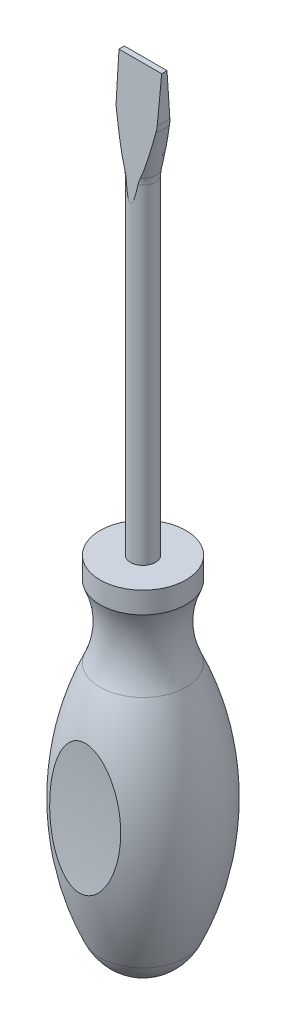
from build123d import *

# Parameters (mm, degrees)
BOSS_EXTRUDE2_DEPTH = 1.5
CUT_EXTRUDE4_DEPTH  = 10
CUT_EXTRUDE5_DEPTH  = 222.63941018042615


with BuildPart() as part:
    # Handle → Revolve1 (revolve)
    with BuildSketch(Plane(origin=(0, 0, 0), x_dir=(0, 0, -1), z_dir=(1, 0, 0)), mode=Mode.PRIVATE) as revolve1_sk:
        with BuildLine():
            Line((11.999999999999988, 100), (11.999999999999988, 94))
            ThreePointArc((11.999999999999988, 94), (9.85445290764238, 84), (11.999999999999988, 74))
            ThreePointArc((11.999999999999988, 74), (19.026666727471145, 41.25), (11.999999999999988, 8.5))
            ThreePointArc((11.999999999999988, 8.5), (7.157479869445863, 2.615910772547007), (0, 0))
            Line((0, 0), (0, 100))
            Line((0, 100), (11.999999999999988, 100))
        make_face()
    revolve(revolve1_sk.sketch.rotate(Axis((0, 100, 0), (0, -1, 0)), 180), axis=Axis((0, 100, 0), (0, -1, 0)))

    # Sketch14 → Cut-Extrude5 (cut, symmetric)
    with BuildSketch(Plane(origin=(0, 0, 0), x_dir=(0, 0, -1), z_dir=(1, 0, 0))):
        with BuildLine():
            Line((20.64658912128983, 27), (20.64658912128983, 62.5))
            Line((20.64658912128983, 62.5), (16.14658912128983, 62.5))
            ThreePointArc((16.14658912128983, 62.5), (16.156571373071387, 44.714393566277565), (17.74658912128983, 27))
            Line((17.74658912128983, 27), (20.64658912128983, 27))
        make_face()
    cut_extrude5 = extrude(amount=CUT_EXTRUDE5_DEPTH, both=True, mode=Mode.SUBTRACT)

    # Mirror1: Cut-Extrude5 across plane
    add(cut_extrude5.mirror(Plane.XY), mode=Mode.SUBTRACT)


with BuildPart() as body_2:
    # Sketch4 → Revolve2 (revolve)
    with BuildSketch(Plane(origin=(0, 0, 0), x_dir=(0, 0, -1), z_dir=(1, 0, 0))):
        with BuildLine():
            Line((3.500000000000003, 192.11414938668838), (3.5000000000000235, 30))
            Line((3.5000000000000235, 30), (0, 30))
            Line((0, 30), (0, 220))
            Line((0, 220), (6, 220))
            Line((6, 220), (6.000000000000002, 207.8858506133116))
            ThreePointArc((6.000000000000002, 207.8858506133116), (5.960992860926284, 207.0034554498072), (5.8442757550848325, 206.127944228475))
            Line((5.8442757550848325, 206.127944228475), (3.6557242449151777, 193.87205577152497))
            ThreePointArc((3.6557242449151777, 193.87205577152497), (3.5390071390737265, 192.99654455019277), (3.500000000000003, 192.11414938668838))
        make_face()
    revolve(axis=Axis((0, 30, 0), (0, 1, 0)))

    # Sketch5 → Boss-Extrude2 (add, symmetric)
    with BuildSketch(Plane.XY):
        Polygon((3.5000000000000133, 80), (7.5, 75), (7.5, 65), (3.5000000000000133, 60), (-3.5000000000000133, 60), (-7.5, 65), (-7.5, 75), (-3.5000000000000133, 80), align=None)
    extrude(amount=BOSS_EXTRUDE2_DEPTH, both=True)

    # Sketch11 → Cut-Extrude4 (cut, symmetric)
    with BuildSketch(Plane(origin=(0, 0, 0), x_dir=(0, 0, -1), z_dir=(1, 0, 0))):
        Polygon((10.893018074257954, 187), (3.5, 187), (0.75, 220), (10.89301807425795, 220), align=None)
        Polygon((-0.75, 220), (-3.5, 187), (-10.893018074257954, 187), (-10.89301807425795, 220), align=None)
    extrude(amount=CUT_EXTRUDE4_DEPTH, both=True, mode=Mode.SUBTRACT)


with BuildPart() as part_1:
    add(part.part)

    # Combine1: union body 2
    add(body_2.part)


solid = part_1.part
